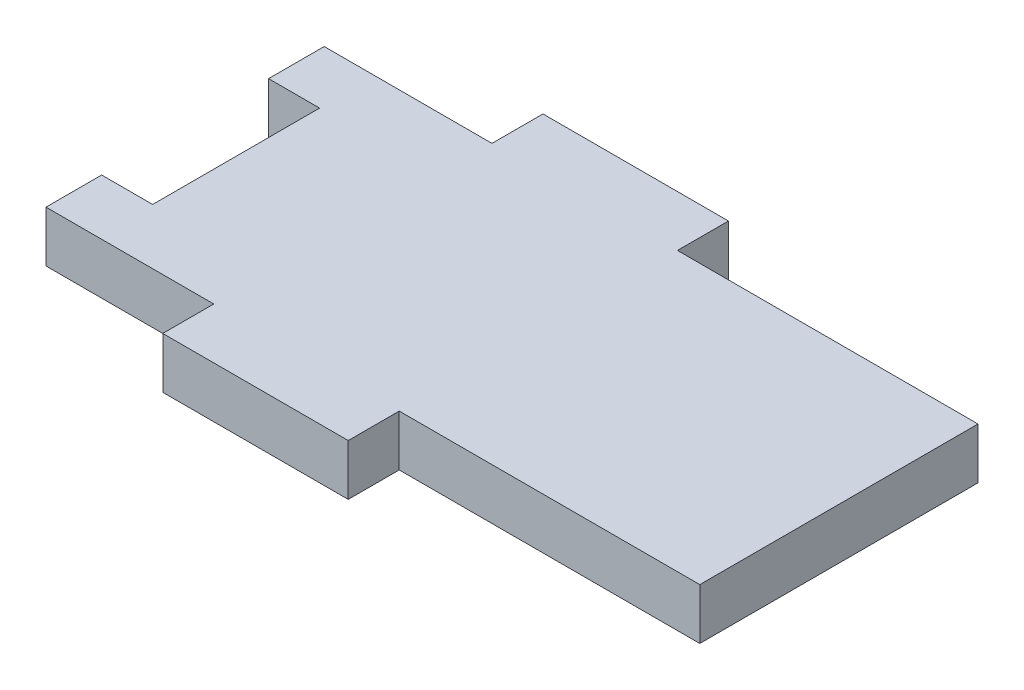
from build123d import *

# Parameters (mm, degrees)
SALIENTE_EXTRUIR1_DEPTH = 5.5


with BuildPart() as part:
    # Croquis1 → Saliente-Extruir1 (new body)
    with BuildSketch(Plane(origin=(0, 0, 0), x_dir=(1, 0, 0), z_dir=(0, 1, 0))):
        Polygon((43.542352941, 9.042941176), (43.542352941, -20.957058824), (11.132352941, -20.957058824), (11.132352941, -26.457058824), (-8.867647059, -26.457058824), (-8.867647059, -20.957058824), (-26.957647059, -20.957058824), (-26.957647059, -14.957058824), (-21.457647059, -14.957058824), (-21.457647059, 3.042941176), (-26.957647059, 3.042941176), (-26.957647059, 9.042941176), (-8.867647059, 9.042941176), (-8.867647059, 14.542941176), (11.132352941, 14.542941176), (11.132352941, 9.042941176), align=None)
    extrude(amount=SALIENTE_EXTRUIR1_DEPTH)


solid = part.part
